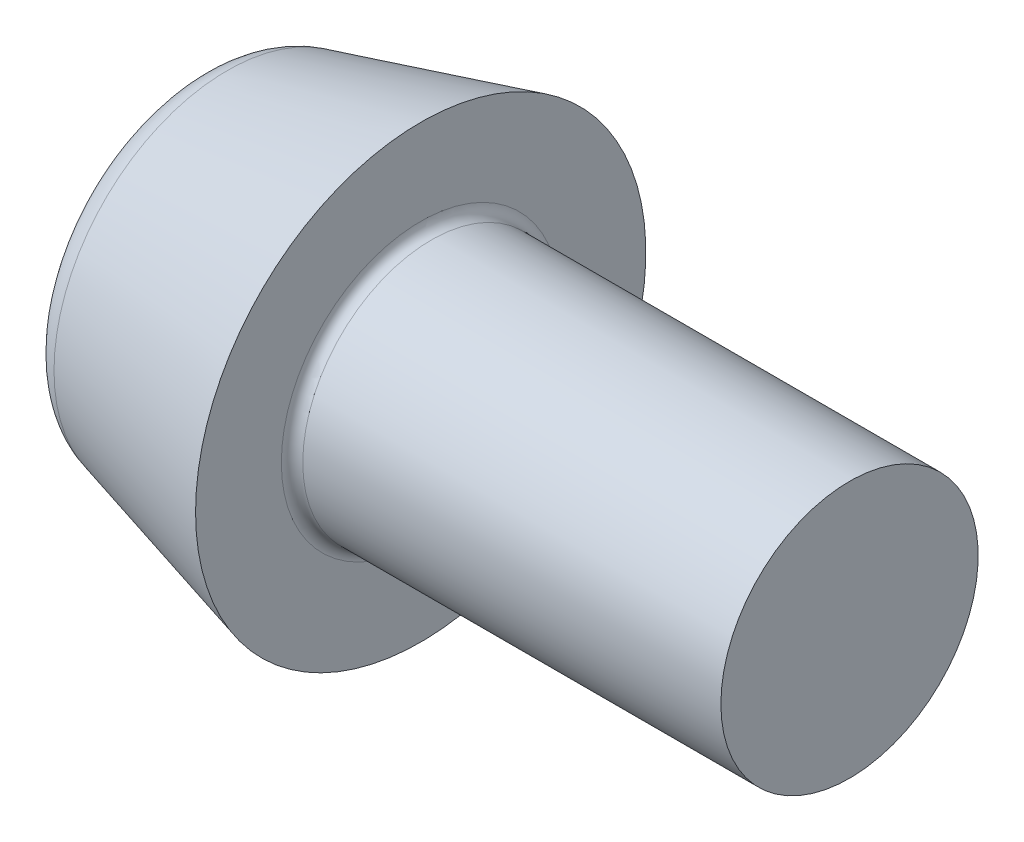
ISO-10303-21;
HEADER;
FILE_DESCRIPTION(('STEP AP214'),'2;1');
FILE_NAME('part.step','',(''),(''),'','','');
FILE_SCHEMA(('AUTOMOTIVE_DESIGN { 1 0 10303 214 1 1 1 1 }'));
ENDSEC;
DATA;
#1=APPLICATION_CONTEXT('core data for automotive mechanical design processes');
#2=APPLICATION_PROTOCOL_DEFINITION('international standard','automotive_design',2000,#1);
#3=PRODUCT_CONTEXT('',#1,'mechanical');
#4=PRODUCT('Part','Part','',(#3));
#5=PRODUCT_RELATED_PRODUCT_CATEGORY('part','',(#4));
#6=PRODUCT_DEFINITION_FORMATION('','',#4);
#7=PRODUCT_DEFINITION_CONTEXT('part definition',#1,'design');
#8=PRODUCT_DEFINITION('design','',#6,#7);
#9=PRODUCT_DEFINITION_SHAPE('','',#8);
#10=(LENGTH_UNIT() NAMED_UNIT(*) SI_UNIT(.MILLI.,.METRE.));
#11=(NAMED_UNIT(*) PLANE_ANGLE_UNIT() SI_UNIT($,.RADIAN.));
#12=(NAMED_UNIT(*) SI_UNIT($,.STERADIAN.) SOLID_ANGLE_UNIT());
#13=UNCERTAINTY_MEASURE_WITH_UNIT(LENGTH_MEASURE(1.E-05),#10,'distance_accuracy_value','');
#14=(GEOMETRIC_REPRESENTATION_CONTEXT(3) GLOBAL_UNCERTAINTY_ASSIGNED_CONTEXT((#13)) GLOBAL_UNIT_ASSIGNED_CONTEXT((#10,
#11,#12)) REPRESENTATION_CONTEXT('',''));
#15=CARTESIAN_POINT('',(0.,0.,0.));
#16=DIRECTION('',(0.,0.,1.));
#17=DIRECTION('',(1.,0.,0.));
#18=AXIS2_PLACEMENT_3D('',#15,#16,#17);
#19=CARTESIAN_POINT('',(0.,7.68653347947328,0.));
#20=DIRECTION('',(1.,0.,0.));
#21=DIRECTION('',(0.,0.,-1.));
#22=AXIS2_PLACEMENT_3D('',#19,#20,#21);
#23=PLANE('',#22);
#24=CARTESIAN_POINT('',(0.,0.,0.));
#25=DIRECTION('',(1.,0.,0.));
#26=DIRECTION('',(0.,0.,-1.));
#27=AXIS2_PLACEMENT_3D('',#24,#25,#26);
#28=CIRCLE('',#27,6.15187950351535);
#29=CARTESIAN_POINT('',(0.,0.,-6.15187950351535));
#30=VERTEX_POINT('',#29);
#31=EDGE_CURVE('E42',#30,#30,#28,.F.);
#32=ORIENTED_EDGE('',*,*,#31,.T.);
#33=EDGE_LOOP('',(#32));
#34=FACE_BOUND('',#33,.T.);
#35=ADVANCED_FACE('F40',(#34),#23,.F.);
#36=CARTESIAN_POINT('',(30.5,0.,0.));
#37=DIRECTION('',(-1.,0.,0.));
#38=DIRECTION('',(0.,0.,1.));
#39=AXIS2_PLACEMENT_3D('',#36,#37,#38);
#40=PLANE('',#39);
#41=CARTESIAN_POINT('',(30.5,0.,0.));
#42=DIRECTION('',(-1.,0.,0.));
#43=DIRECTION('',(0.,0.,1.));
#44=AXIS2_PLACEMENT_3D('',#41,#42,#43);
#45=CIRCLE('',#44,6.);
#46=CARTESIAN_POINT('',(30.5,0.,6.));
#47=VERTEX_POINT('',#46);
#48=EDGE_CURVE('E60',#47,#47,#45,.T.);
#49=ORIENTED_EDGE('',*,*,#48,.F.);
#50=EDGE_LOOP('',(#49));
#51=FACE_BOUND('',#50,.T.);
#52=ADVANCED_FACE('F76',(#51),#40,.F.);
#53=CARTESIAN_POINT('',(-26.4885714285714,0.,0.));
#54=DIRECTION('',(-1.,0.,0.));
#55=DIRECTION('',(0.,0.,1.));
#56=AXIS2_PLACEMENT_3D('',#53,#54,#55);
#57=CYLINDRICAL_SURFACE('',#56,6.);
#58=CARTESIAN_POINT('',(11.,0.,0.));
#59=DIRECTION('',(-1.,0.,0.));
#60=DIRECTION('',(0.,0.,1.));
#61=AXIS2_PLACEMENT_3D('',#58,#59,#60);
#62=CIRCLE('',#61,6.);
#63=CARTESIAN_POINT('',(11.,0.,6.));
#64=VERTEX_POINT('',#63);
#65=EDGE_CURVE('E48',#64,#64,#62,.F.);
#66=ORIENTED_EDGE('',*,*,#65,.T.);
#67=EDGE_LOOP('',(#66));
#68=FACE_BOUND('',#67,.T.);
#69=ORIENTED_EDGE('',*,*,#48,.T.);
#70=EDGE_LOOP('',(#69));
#71=FACE_BOUND('',#70,.T.);
#72=ADVANCED_FACE('F67',(#68,#71),#57,.T.);
#73=CARTESIAN_POINT('',(10.5,6.,0.));
#74=DIRECTION('',(-1.,0.,0.));
#75=DIRECTION('',(0.,0.,1.));
#76=AXIS2_PLACEMENT_3D('',#73,#74,#75);
#77=PLANE('',#76);
#78=CARTESIAN_POINT('',(10.5,0.,0.));
#79=DIRECTION('',(-1.,0.,0.));
#80=DIRECTION('',(0.,0.,1.));
#81=AXIS2_PLACEMENT_3D('',#78,#79,#80);
#82=CIRCLE('',#81,6.5);
#83=CARTESIAN_POINT('',(10.5,0.,6.5));
#84=VERTEX_POINT('',#83);
#85=EDGE_CURVE('E55',#84,#84,#82,.T.);
#86=ORIENTED_EDGE('',*,*,#85,.T.);
#87=EDGE_LOOP('',(#86));
#88=FACE_BOUND('',#87,.T.);
#89=CARTESIAN_POINT('',(10.5,0.,0.));
#90=DIRECTION('',(-1.,0.,0.));
#91=DIRECTION('',(0.,0.,1.));
#92=AXIS2_PLACEMENT_3D('',#89,#90,#91);
#93=CIRCLE('',#92,10.5);
#94=CARTESIAN_POINT('',(10.5,0.,10.5));
#95=VERTEX_POINT('',#94);
#96=EDGE_CURVE('E58',#95,#95,#93,.T.);
#97=ORIENTED_EDGE('',*,*,#96,.F.);
#98=EDGE_LOOP('',(#97));
#99=FACE_BOUND('',#98,.T.);
#100=ADVANCED_FACE('F66',(#88,#99),#77,.F.);
#101=CARTESIAN_POINT('',(10.5,0.,0.));
#102=DIRECTION('',(1.,0.,0.));
#103=DIRECTION('',(0.,0.,-1.));
#104=AXIS2_PLACEMENT_3D('',#101,#102,#103);
#105=CONICAL_SURFACE('',#104,10.5,0.261799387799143);
#106=CARTESIAN_POINT('',(1.48236190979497,0.,0.));
#107=DIRECTION('',(-1.,0.,0.));
#108=DIRECTION('',(0.,0.,1.));
#109=AXIS2_PLACEMENT_3D('',#106,#107,#108);
#110=CIRCLE('',#109,8.08373115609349);
#111=CARTESIAN_POINT('',(1.48236190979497,0.,8.08373115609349));
#112=VERTEX_POINT('',#111);
#113=EDGE_CURVE('E10',#112,#112,#110,.F.);
#114=ORIENTED_EDGE('',*,*,#113,.T.);
#115=EDGE_LOOP('',(#114));
#116=FACE_BOUND('',#115,.T.);
#117=ORIENTED_EDGE('',*,*,#96,.T.);
#118=EDGE_LOOP('',(#117));
#119=FACE_BOUND('',#118,.T.);
#120=ADVANCED_FACE('F63',(#116,#119),#105,.T.);
#121=CARTESIAN_POINT('',(11.,0.,0.));
#122=DIRECTION('',(-1.,0.,0.));
#123=DIRECTION('',(0.,0.,1.));
#124=AXIS2_PLACEMENT_3D('',#121,#122,#123);
#125=TOROIDAL_SURFACE('',#124,6.5,0.5);
#126=ORIENTED_EDGE('',*,*,#65,.F.);
#127=EDGE_LOOP('',(#126));
#128=FACE_BOUND('',#127,.T.);
#129=ORIENTED_EDGE('',*,*,#85,.F.);
#130=EDGE_LOOP('',(#129));
#131=FACE_BOUND('',#130,.T.);
#132=ADVANCED_FACE('F77',(#128,#131),#125,.F.);
#133=CARTESIAN_POINT('',(2.,0.,0.));
#134=DIRECTION('',(1.,0.,0.));
#135=DIRECTION('',(0.,0.,-1.));
#136=AXIS2_PLACEMENT_3D('',#133,#134,#135);
#137=TOROIDAL_SURFACE('',#136,6.15187950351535,2.);
#138=ORIENTED_EDGE('',*,*,#113,.F.);
#139=EDGE_LOOP('',(#138));
#140=FACE_BOUND('',#139,.T.);
#141=ORIENTED_EDGE('',*,*,#31,.F.);
#142=EDGE_LOOP('',(#141));
#143=FACE_BOUND('',#142,.T.);
#144=ADVANCED_FACE('F39',(#140,#143),#137,.T.);
#145=CLOSED_SHELL('',(#35,#52,#72,#100,#120,#132,#144));
#146=MANIFOLD_SOLID_BREP('B2',#145);
#147=ADVANCED_BREP_SHAPE_REPRESENTATION('',(#18,#146),#14);
#148=SHAPE_DEFINITION_REPRESENTATION(#9,#147);
ENDSEC;
END-ISO-10303-21;
